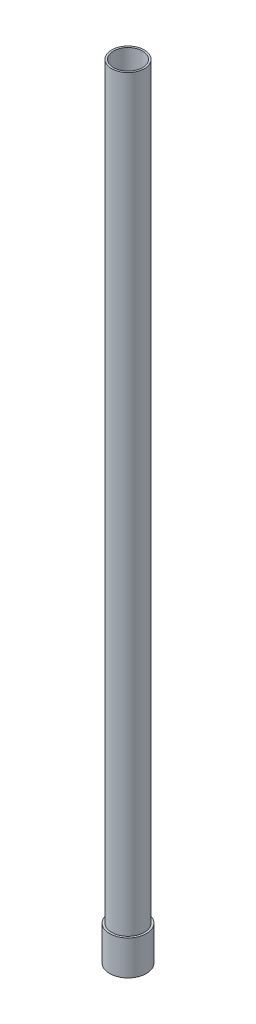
from build123d import *


with BuildPart() as part:
    # Sketch2 → Revolve1 (revolve)
    with BuildSketch(Plane.XY, mode=Mode.PRIVATE) as revolve1_sk:
        Polygon((-5.6388, 0), (-7.14375, 0), (-7.14375, 13.4874), (-6.35, 13.4874), (-6.35, 304.8), (-5.6388, 304.8), align=None)
    revolve(revolve1_sk.sketch.rotate(Axis((0, 0, 0), (0, 1, 0)), 270), axis=Axis((0, 0, 0), (0, 1, 0)))


solid = part.part
